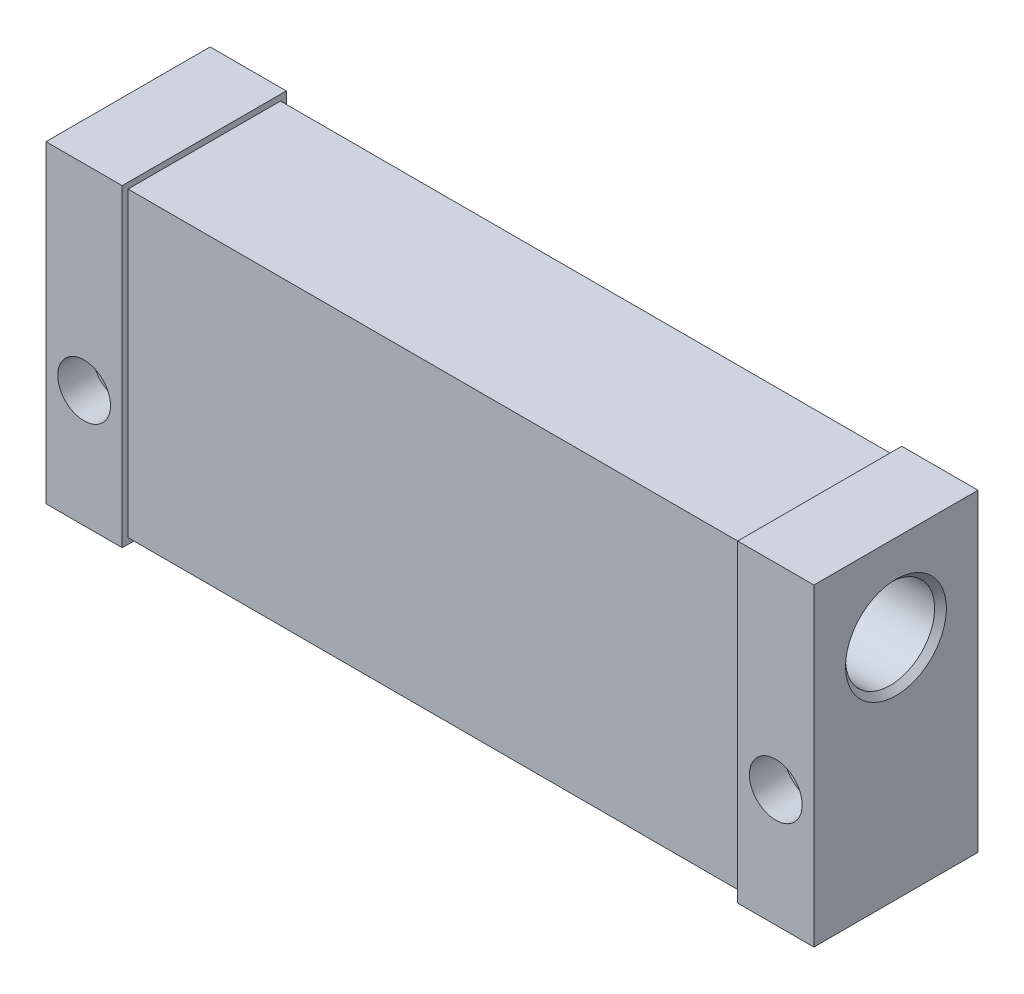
ISO-10303-21;
HEADER;
FILE_DESCRIPTION(('STEP AP214'),'2;1');
FILE_NAME('part.step','',(''),(''),'','','');
FILE_SCHEMA(('AUTOMOTIVE_DESIGN { 1 0 10303 214 1 1 1 1 }'));
ENDSEC;
DATA;
#1=APPLICATION_CONTEXT('core data for automotive mechanical design processes');
#2=APPLICATION_PROTOCOL_DEFINITION('international standard','automotive_design',2000,#1);
#3=PRODUCT_CONTEXT('',#1,'mechanical');
#4=PRODUCT('Part','Part','',(#3));
#5=PRODUCT_RELATED_PRODUCT_CATEGORY('part','',(#4));
#6=PRODUCT_DEFINITION_FORMATION('','',#4);
#7=PRODUCT_DEFINITION_CONTEXT('part definition',#1,'design');
#8=PRODUCT_DEFINITION('design','',#6,#7);
#9=PRODUCT_DEFINITION_SHAPE('','',#8);
#10=(LENGTH_UNIT() NAMED_UNIT(*) SI_UNIT(.MILLI.,.METRE.));
#11=(NAMED_UNIT(*) PLANE_ANGLE_UNIT() SI_UNIT($,.RADIAN.));
#12=(NAMED_UNIT(*) SI_UNIT($,.STERADIAN.) SOLID_ANGLE_UNIT());
#13=UNCERTAINTY_MEASURE_WITH_UNIT(LENGTH_MEASURE(1.E-05),#10,'distance_accuracy_value','');
#14=(GEOMETRIC_REPRESENTATION_CONTEXT(3) GLOBAL_UNCERTAINTY_ASSIGNED_CONTEXT((#13)) GLOBAL_UNIT_ASSIGNED_CONTEXT((#10,
#11,#12)) REPRESENTATION_CONTEXT('',''));
#15=CARTESIAN_POINT('',(0.,0.,0.));
#16=DIRECTION('',(0.,0.,1.));
#17=DIRECTION('',(1.,0.,0.));
#18=AXIS2_PLACEMENT_3D('',#15,#16,#17);
#19=CARTESIAN_POINT('',(-65.5,-26.75,14.));
#20=DIRECTION('',(0.,1.,0.));
#21=DIRECTION('',(0.,0.,1.));
#22=AXIS2_PLACEMENT_3D('',#19,#20,#21);
#23=PLANE('',#22);
#24=CARTESIAN_POINT('',(59.6552513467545,-26.75,-3.));
#25=DIRECTION('',(0.,-1.,0.));
#26=DIRECTION('',(0.,0.,-1.));
#27=AXIS2_PLACEMENT_3D('',#24,#25,#26);
#28=CIRCLE('',#27,2.1);
#29=CARTESIAN_POINT('',(59.6552513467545,-26.75,-5.1));
#30=VERTEX_POINT('',#29);
#31=EDGE_CURVE('E151',#30,#30,#28,.T.);
#32=ORIENTED_EDGE('',*,*,#31,.F.);
#33=EDGE_LOOP('',(#32));
#34=FACE_BOUND('',#33,.T.);
#35=DIRECTION('',(1.,0.,0.));
#36=VECTOR('',#35,1.);
#37=CARTESIAN_POINT('',(-65.5,-26.75,14.));
#38=LINE('',#37,#36);
#39=CARTESIAN_POINT('',(52.5,-26.75,14.));
#40=VERTEX_POINT('',#39);
#41=CARTESIAN_POINT('',(65.5,-26.75,14.));
#42=VERTEX_POINT('',#41);
#43=EDGE_CURVE('E271',#40,#42,#38,.T.);
#44=ORIENTED_EDGE('',*,*,#43,.F.);
#45=DIRECTION('',(0.,0.,-1.));
#46=VECTOR('',#45,1.);
#47=CARTESIAN_POINT('',(52.5,-26.75,14.));
#48=LINE('',#47,#46);
#49=CARTESIAN_POINT('',(52.5,-26.75,-14.));
#50=VERTEX_POINT('',#49);
#51=EDGE_CURVE('E272',#40,#50,#48,.T.);
#52=ORIENTED_EDGE('',*,*,#51,.T.);
#53=DIRECTION('',(1.,0.,0.));
#54=VECTOR('',#53,1.);
#55=CARTESIAN_POINT('',(-65.5,-26.75,-14.));
#56=LINE('',#55,#54);
#57=CARTESIAN_POINT('',(65.5,-26.75,-14.));
#58=VERTEX_POINT('',#57);
#59=EDGE_CURVE('E347',#50,#58,#56,.T.);
#60=ORIENTED_EDGE('',*,*,#59,.T.);
#61=DIRECTION('',(0.,0.,-1.));
#62=VECTOR('',#61,1.);
#63=CARTESIAN_POINT('',(65.5,-26.75,14.));
#64=LINE('',#63,#62);
#65=EDGE_CURVE('E275',#42,#58,#64,.T.);
#66=ORIENTED_EDGE('',*,*,#65,.F.);
#67=EDGE_LOOP('',(#44,#52,#60,#66));
#68=FACE_BOUND('',#67,.T.);
#69=ADVANCED_FACE('F41',(#34,#68),#23,.F.);
#70=CARTESIAN_POINT('',(-65.5,26.75,14.));
#71=DIRECTION('',(0.,-1.,0.));
#72=DIRECTION('',(0.,0.,-1.));
#73=AXIS2_PLACEMENT_3D('',#70,#71,#72);
#74=PLANE('',#73);
#75=DIRECTION('',(-1.,0.,0.));
#76=VECTOR('',#75,1.);
#77=CARTESIAN_POINT('',(-65.5,26.75,-14.));
#78=LINE('',#77,#76);
#79=CARTESIAN_POINT('',(65.5,26.75,-14.));
#80=VERTEX_POINT('',#79);
#81=CARTESIAN_POINT('',(52.5,26.75,-14.));
#82=VERTEX_POINT('',#81);
#83=EDGE_CURVE('E285',#80,#82,#78,.T.);
#84=ORIENTED_EDGE('',*,*,#83,.T.);
#85=DIRECTION('',(0.,0.,1.));
#86=VECTOR('',#85,1.);
#87=CARTESIAN_POINT('',(52.5,26.75,14.));
#88=LINE('',#87,#86);
#89=CARTESIAN_POINT('',(52.5,26.75,14.));
#90=VERTEX_POINT('',#89);
#91=EDGE_CURVE('E64',#82,#90,#88,.T.);
#92=ORIENTED_EDGE('',*,*,#91,.T.);
#93=DIRECTION('',(-1.,0.,0.));
#94=VECTOR('',#93,1.);
#95=CARTESIAN_POINT('',(-65.5,26.75,14.));
#96=LINE('',#95,#94);
#97=CARTESIAN_POINT('',(65.5,26.75,14.));
#98=VERTEX_POINT('',#97);
#99=EDGE_CURVE('E291',#98,#90,#96,.T.);
#100=ORIENTED_EDGE('',*,*,#99,.F.);
#101=DIRECTION('',(0.,0.,-1.));
#102=VECTOR('',#101,1.);
#103=CARTESIAN_POINT('',(65.5,26.75,14.));
#104=LINE('',#103,#102);
#105=EDGE_CURVE('E297',#98,#80,#104,.T.);
#106=ORIENTED_EDGE('',*,*,#105,.T.);
#107=EDGE_LOOP('',(#84,#92,#100,#106));
#108=FACE_BOUND('',#107,.T.);
#109=ADVANCED_FACE('F246',(#108),#74,.F.);
#110=CARTESIAN_POINT('',(-65.5,-26.75,14.));
#111=DIRECTION('',(0.,0.,1.));
#112=DIRECTION('',(1.,0.,0.));
#113=AXIS2_PLACEMENT_3D('',#110,#111,#112);
#114=PLANE('',#113);
#115=CARTESIAN_POINT('',(59.,-6.75,14.));
#116=DIRECTION('',(0.,0.,1.));
#117=DIRECTION('',(1.,0.,0.));
#118=AXIS2_PLACEMENT_3D('',#115,#116,#117);
#119=CIRCLE('',#118,4.5);
#120=CARTESIAN_POINT('',(63.5,-6.75,14.));
#121=VERTEX_POINT('',#120);
#122=EDGE_CURVE('E175',#121,#121,#119,.T.);
#123=ORIENTED_EDGE('',*,*,#122,.F.);
#124=EDGE_LOOP('',(#123));
#125=FACE_BOUND('',#124,.T.);
#126=DIRECTION('',(0.,1.,0.));
#127=VECTOR('',#126,1.);
#128=CARTESIAN_POINT('',(52.5,-26.75,14.));
#129=LINE('',#128,#127);
#130=EDGE_CURVE('E351',#40,#90,#129,.T.);
#131=ORIENTED_EDGE('',*,*,#130,.F.);
#132=ORIENTED_EDGE('',*,*,#43,.T.);
#133=DIRECTION('',(0.,1.,0.));
#134=VECTOR('',#133,1.);
#135=CARTESIAN_POINT('',(65.5,26.75,14.));
#136=LINE('',#135,#134);
#137=EDGE_CURVE('E283',#42,#98,#136,.T.);
#138=ORIENTED_EDGE('',*,*,#137,.T.);
#139=ORIENTED_EDGE('',*,*,#99,.T.);
#140=EDGE_LOOP('',(#131,#132,#138,#139));
#141=FACE_BOUND('',#140,.T.);
#142=ADVANCED_FACE('F241',(#125,#141),#114,.T.);
#143=CARTESIAN_POINT('',(-65.5,-26.75,-14.));
#144=DIRECTION('',(0.,0.,1.));
#145=DIRECTION('',(1.,0.,0.));
#146=AXIS2_PLACEMENT_3D('',#143,#144,#145);
#147=PLANE('',#146);
#148=CARTESIAN_POINT('',(59.,-6.75,-14.));
#149=DIRECTION('',(0.,0.,1.));
#150=DIRECTION('',(1.,0.,0.));
#151=AXIS2_PLACEMENT_3D('',#148,#149,#150);
#152=CIRCLE('',#151,2.74999999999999);
#153=CARTESIAN_POINT('',(61.75,-6.75,-14.));
#154=VERTEX_POINT('',#153);
#155=EDGE_CURVE('E166',#154,#154,#152,.T.);
#156=ORIENTED_EDGE('',*,*,#155,.T.);
#157=EDGE_LOOP('',(#156));
#158=FACE_BOUND('',#157,.T.);
#159=ORIENTED_EDGE('',*,*,#59,.F.);
#160=DIRECTION('',(0.,1.,0.));
#161=VECTOR('',#160,1.);
#162=CARTESIAN_POINT('',(52.5,-26.75,-14.));
#163=LINE('',#162,#161);
#164=EDGE_CURVE('E306',#50,#82,#163,.T.);
#165=ORIENTED_EDGE('',*,*,#164,.T.);
#166=ORIENTED_EDGE('',*,*,#83,.F.);
#167=DIRECTION('',(0.,1.,0.));
#168=VECTOR('',#167,1.);
#169=CARTESIAN_POINT('',(65.5,26.75,-14.));
#170=LINE('',#169,#168);
#171=EDGE_CURVE('E336',#58,#80,#170,.T.);
#172=ORIENTED_EDGE('',*,*,#171,.F.);
#173=EDGE_LOOP('',(#159,#165,#166,#172));
#174=FACE_BOUND('',#173,.T.);
#175=ADVANCED_FACE('F236',(#158,#174),#147,.F.);
#176=CARTESIAN_POINT('',(65.5,26.75,14.));
#177=DIRECTION('',(-1.,0.,0.));
#178=DIRECTION('',(0.,0.,1.));
#179=AXIS2_PLACEMENT_3D('',#176,#177,#178);
#180=PLANE('',#179);
#181=CARTESIAN_POINT('',(65.5,12.,0.));
#182=DIRECTION('',(-1.,0.,0.));
#183=DIRECTION('',(0.,0.,1.));
#184=AXIS2_PLACEMENT_3D('',#181,#182,#183);
#185=CIRCLE('',#184,8.6);
#186=CARTESIAN_POINT('',(65.5,12.,8.6));
#187=VERTEX_POINT('',#186);
#188=EDGE_CURVE('E12',#187,#187,#185,.T.);
#189=ORIENTED_EDGE('',*,*,#188,.T.);
#190=EDGE_LOOP('',(#189));
#191=FACE_BOUND('',#190,.T.);
#192=ORIENTED_EDGE('',*,*,#171,.T.);
#193=ORIENTED_EDGE('',*,*,#105,.F.);
#194=ORIENTED_EDGE('',*,*,#137,.F.);
#195=ORIENTED_EDGE('',*,*,#65,.T.);
#196=EDGE_LOOP('',(#192,#193,#194,#195));
#197=FACE_BOUND('',#196,.T.);
#198=ADVANCED_FACE('F229',(#191,#197),#180,.F.);
#199=CARTESIAN_POINT('',(-52.5,-25.75,13.));
#200=DIRECTION('',(0.,0.,1.));
#201=DIRECTION('',(1.,0.,0.));
#202=AXIS2_PLACEMENT_3D('',#199,#200,#201);
#203=PLANE('',#202);
#204=CARTESIAN_POINT('',(52.5,25.75,13.));
#205=DIRECTION('',(-1.,0.,0.));
#206=VECTOR('',#205,1.);
#207=LINE('',#204,#206);
#208=CARTESIAN_POINT('',(52.5,25.75,13.));
#209=VERTEX_POINT('',#208);
#210=CARTESIAN_POINT('',(-52.5,25.75,13.));
#211=VERTEX_POINT('',#210);
#212=EDGE_CURVE('E205',#209,#211,#207,.T.);
#213=ORIENTED_EDGE('',*,*,#212,.T.);
#214=DIRECTION('',(0.,1.,0.));
#215=VECTOR('',#214,1.);
#216=CARTESIAN_POINT('',(-52.5,-25.75,13.));
#217=LINE('',#216,#215);
#218=CARTESIAN_POINT('',(-52.5,-25.75,13.));
#219=VERTEX_POINT('',#218);
#220=EDGE_CURVE('E182',#219,#211,#217,.T.);
#221=ORIENTED_EDGE('',*,*,#220,.F.);
#222=DIRECTION('',(1.,0.,0.));
#223=VECTOR('',#222,1.);
#224=CARTESIAN_POINT('',(-52.5,-25.75,13.));
#225=LINE('',#224,#223);
#226=CARTESIAN_POINT('',(52.5,-25.7499999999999,13.));
#227=VERTEX_POINT('',#226);
#228=EDGE_CURVE('E179',#219,#227,#225,.T.);
#229=ORIENTED_EDGE('',*,*,#228,.T.);
#230=DIRECTION('',(0.,1.,0.));
#231=VECTOR('',#230,1.);
#232=CARTESIAN_POINT('',(52.5,-25.7499999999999,13.));
#233=LINE('',#232,#231);
#234=EDGE_CURVE('E202',#227,#209,#233,.T.);
#235=ORIENTED_EDGE('',*,*,#234,.T.);
#236=EDGE_LOOP('',(#213,#221,#229,#235));
#237=FACE_BOUND('',#236,.T.);
#238=ADVANCED_FACE('F218',(#237),#203,.T.);
#239=CARTESIAN_POINT('',(-52.5,-25.75,-13.));
#240=DIRECTION('',(0.,1.,0.));
#241=DIRECTION('',(-1.,0.,0.));
#242=AXIS2_PLACEMENT_3D('',#239,#240,#241);
#243=PLANE('',#242);
#244=DIRECTION('',(0.,0.,1.));
#245=VECTOR('',#244,1.);
#246=CARTESIAN_POINT('',(-52.5,-25.75,-13.));
#247=LINE('',#246,#245);
#248=CARTESIAN_POINT('',(-52.5,-25.75,-13.));
#249=VERTEX_POINT('',#248);
#250=EDGE_CURVE('E187',#249,#219,#247,.T.);
#251=ORIENTED_EDGE('',*,*,#250,.F.);
#252=DIRECTION('',(-1.,0.,0.));
#253=VECTOR('',#252,1.);
#254=CARTESIAN_POINT('',(-52.5,-25.75,-13.));
#255=LINE('',#254,#253);
#256=CARTESIAN_POINT('',(52.5,-25.75,-13.));
#257=VERTEX_POINT('',#256);
#258=EDGE_CURVE('E184',#257,#249,#255,.T.);
#259=ORIENTED_EDGE('',*,*,#258,.F.);
#260=DIRECTION('',(0.,0.,1.));
#261=VECTOR('',#260,1.);
#262=CARTESIAN_POINT('',(52.5,-25.75,-13.));
#263=LINE('',#262,#261);
#264=EDGE_CURVE('E183',#257,#227,#263,.T.);
#265=ORIENTED_EDGE('',*,*,#264,.T.);
#266=ORIENTED_EDGE('',*,*,#228,.F.);
#267=EDGE_LOOP('',(#251,#259,#265,#266));
#268=FACE_BOUND('',#267,.T.);
#269=ADVANCED_FACE('F228',(#268),#243,.F.);
#270=CARTESIAN_POINT('',(-52.5000000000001,25.75,-13.));
#271=DIRECTION('',(0.,0.,-1.));
#272=DIRECTION('',(-1.,0.,0.));
#273=AXIS2_PLACEMENT_3D('',#270,#271,#272);
#274=PLANE('',#273);
#275=ORIENTED_EDGE('',*,*,#258,.T.);
#276=DIRECTION('',(0.,-1.,0.));
#277=VECTOR('',#276,1.);
#278=CARTESIAN_POINT('',(-52.5,25.75,-13.));
#279=LINE('',#278,#277);
#280=CARTESIAN_POINT('',(-52.5,25.75,-13.));
#281=VERTEX_POINT('',#280);
#282=EDGE_CURVE('E192',#281,#249,#279,.T.);
#283=ORIENTED_EDGE('',*,*,#282,.F.);
#284=DIRECTION('',(1.,0.,0.));
#285=VECTOR('',#284,1.);
#286=CARTESIAN_POINT('',(-52.5000000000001,25.75,-13.));
#287=LINE('',#286,#285);
#288=CARTESIAN_POINT('',(52.5,25.75,-13.));
#289=VERTEX_POINT('',#288);
#290=EDGE_CURVE('E189',#281,#289,#287,.T.);
#291=ORIENTED_EDGE('',*,*,#290,.T.);
#292=DIRECTION('',(0.,-1.,0.));
#293=VECTOR('',#292,1.);
#294=CARTESIAN_POINT('',(52.5,25.75,-13.));
#295=LINE('',#294,#293);
#296=EDGE_CURVE('E188',#289,#257,#295,.T.);
#297=ORIENTED_EDGE('',*,*,#296,.T.);
#298=EDGE_LOOP('',(#275,#283,#291,#297));
#299=FACE_BOUND('',#298,.T.);
#300=ADVANCED_FACE('F380',(#299),#274,.T.);
#301=CARTESIAN_POINT('',(-52.5,25.75,-225.388235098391));
#302=DIRECTION('',(0.,-1.,0.));
#303=DIRECTION('',(0.,0.,-1.));
#304=AXIS2_PLACEMENT_3D('',#301,#302,#303);
#305=PLANE('',#304);
#306=DIRECTION('',(0.,0.,1.));
#307=VECTOR('',#306,1.);
#308=CARTESIAN_POINT('',(-52.5,25.75,-225.388235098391));
#309=LINE('',#308,#307);
#310=EDGE_CURVE('E178',#281,#211,#309,.T.);
#311=ORIENTED_EDGE('',*,*,#310,.T.);
#312=ORIENTED_EDGE('',*,*,#212,.F.);
#313=DIRECTION('',(0.,0.,1.));
#314=VECTOR('',#313,1.);
#315=CARTESIAN_POINT('',(52.5,25.75,-225.388235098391));
#316=LINE('',#315,#314);
#317=EDGE_CURVE('E193',#289,#209,#316,.T.);
#318=ORIENTED_EDGE('',*,*,#317,.F.);
#319=ORIENTED_EDGE('',*,*,#290,.F.);
#320=EDGE_LOOP('',(#311,#312,#318,#319));
#321=FACE_BOUND('',#320,.T.);
#322=ADVANCED_FACE('F369',(#321),#305,.F.);
#323=CARTESIAN_POINT('',(52.5,29.0354580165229,-225.388235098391));
#324=DIRECTION('',(1.,0.,0.));
#325=DIRECTION('',(0.,0.,-1.));
#326=AXIS2_PLACEMENT_3D('',#323,#324,#325);
#327=PLANE('',#326);
#328=ORIENTED_EDGE('',*,*,#130,.T.);
#329=ORIENTED_EDGE('',*,*,#91,.F.);
#330=ORIENTED_EDGE('',*,*,#164,.F.);
#331=ORIENTED_EDGE('',*,*,#51,.F.);
#332=EDGE_LOOP('',(#328,#329,#330,#331));
#333=FACE_BOUND('',#332,.T.);
#334=ORIENTED_EDGE('',*,*,#317,.T.);
#335=ORIENTED_EDGE('',*,*,#234,.F.);
#336=ORIENTED_EDGE('',*,*,#264,.F.);
#337=ORIENTED_EDGE('',*,*,#296,.F.);
#338=EDGE_LOOP('',(#334,#335,#336,#337));
#339=FACE_BOUND('',#338,.T.);
#340=ADVANCED_FACE('F379',(#333,#339),#327,.F.);
#341=CARTESIAN_POINT('',(-52.5,25.75,-225.388235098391));
#342=DIRECTION('',(-1.,0.,0.));
#343=DIRECTION('',(0.,0.,1.));
#344=AXIS2_PLACEMENT_3D('',#341,#342,#343);
#345=PLANE('',#344);
#346=DIRECTION('',(0.,-1.,0.));
#347=VECTOR('',#346,1.);
#348=CARTESIAN_POINT('',(-52.5,-26.75,14.));
#349=LINE('',#348,#347);
#350=CARTESIAN_POINT('',(-52.5,26.75,14.));
#351=VERTEX_POINT('',#350);
#352=CARTESIAN_POINT('',(-52.5,-26.75,14.));
#353=VERTEX_POINT('',#352);
#354=EDGE_CURVE('E355',#351,#353,#349,.T.);
#355=ORIENTED_EDGE('',*,*,#354,.T.);
#356=DIRECTION('',(0.,0.,1.));
#357=VECTOR('',#356,1.);
#358=CARTESIAN_POINT('',(-52.5,-26.75,14.));
#359=LINE('',#358,#357);
#360=CARTESIAN_POINT('',(-52.5,-26.75,-14.));
#361=VERTEX_POINT('',#360);
#362=EDGE_CURVE('E56',#361,#353,#359,.T.);
#363=ORIENTED_EDGE('',*,*,#362,.F.);
#364=DIRECTION('',(0.,-1.,0.));
#365=VECTOR('',#364,1.);
#366=CARTESIAN_POINT('',(-52.5,-26.75,-14.));
#367=LINE('',#366,#365);
#368=CARTESIAN_POINT('',(-52.5,26.75,-14.));
#369=VERTEX_POINT('',#368);
#370=EDGE_CURVE('E304',#369,#361,#367,.T.);
#371=ORIENTED_EDGE('',*,*,#370,.F.);
#372=DIRECTION('',(0.,0.,-1.));
#373=VECTOR('',#372,1.);
#374=CARTESIAN_POINT('',(-52.5,26.75,14.));
#375=LINE('',#374,#373);
#376=EDGE_CURVE('E358',#351,#369,#375,.T.);
#377=ORIENTED_EDGE('',*,*,#376,.F.);
#378=EDGE_LOOP('',(#355,#363,#371,#377));
#379=FACE_BOUND('',#378,.T.);
#380=ORIENTED_EDGE('',*,*,#282,.T.);
#381=ORIENTED_EDGE('',*,*,#250,.T.);
#382=ORIENTED_EDGE('',*,*,#220,.T.);
#383=ORIENTED_EDGE('',*,*,#310,.F.);
#384=EDGE_LOOP('',(#380,#381,#382,#383));
#385=FACE_BOUND('',#384,.T.);
#386=ADVANCED_FACE('F382',(#379,#385),#345,.F.);
#387=CARTESIAN_POINT('',(-65.5,26.75,14.));
#388=DIRECTION('',(1.,0.,0.));
#389=DIRECTION('',(0.,1.,0.));
#390=AXIS2_PLACEMENT_3D('',#387,#388,#389);
#391=PLANE('',#390);
#392=CARTESIAN_POINT('',(-65.5,12.,0.));
#393=DIRECTION('',(1.,0.,0.));
#394=DIRECTION('',(0.,1.,0.));
#395=AXIS2_PLACEMENT_3D('',#392,#393,#394);
#396=CIRCLE('',#395,8.60000000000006);
#397=CARTESIAN_POINT('',(-65.5,20.6000000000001,0.));
#398=VERTEX_POINT('',#397);
#399=EDGE_CURVE('E49',#398,#398,#396,.T.);
#400=ORIENTED_EDGE('',*,*,#399,.T.);
#401=EDGE_LOOP('',(#400));
#402=FACE_BOUND('',#401,.T.);
#403=DIRECTION('',(0.,-1.,0.));
#404=VECTOR('',#403,1.);
#405=CARTESIAN_POINT('',(-65.5,26.75,-14.));
#406=LINE('',#405,#404);
#407=CARTESIAN_POINT('',(-65.5,26.75,-14.));
#408=VERTEX_POINT('',#407);
#409=CARTESIAN_POINT('',(-65.5,-26.75,-14.));
#410=VERTEX_POINT('',#409);
#411=EDGE_CURVE('E348',#408,#410,#406,.T.);
#412=ORIENTED_EDGE('',*,*,#411,.T.);
#413=DIRECTION('',(0.,0.,-1.));
#414=VECTOR('',#413,1.);
#415=CARTESIAN_POINT('',(-65.5,-26.75,14.));
#416=LINE('',#415,#414);
#417=CARTESIAN_POINT('',(-65.5,-26.75,14.));
#418=VERTEX_POINT('',#417);
#419=EDGE_CURVE('E301',#418,#410,#416,.T.);
#420=ORIENTED_EDGE('',*,*,#419,.F.);
#421=DIRECTION('',(0.,-1.,0.));
#422=VECTOR('',#421,1.);
#423=CARTESIAN_POINT('',(-65.5,26.75,14.));
#424=LINE('',#423,#422);
#425=CARTESIAN_POINT('',(-65.5,26.75,14.));
#426=VERTEX_POINT('',#425);
#427=EDGE_CURVE('E280',#426,#418,#424,.T.);
#428=ORIENTED_EDGE('',*,*,#427,.F.);
#429=DIRECTION('',(0.,0.,-1.));
#430=VECTOR('',#429,1.);
#431=CARTESIAN_POINT('',(-65.5,26.75,14.));
#432=LINE('',#431,#430);
#433=EDGE_CURVE('E294',#426,#408,#432,.T.);
#434=ORIENTED_EDGE('',*,*,#433,.T.);
#435=EDGE_LOOP('',(#412,#420,#428,#434));
#436=FACE_BOUND('',#435,.T.);
#437=ADVANCED_FACE('F43',(#402,#436),#391,.F.);
#438=CARTESIAN_POINT('',(-59.,-6.75,-14.));
#439=DIRECTION('',(0.,0.,1.));
#440=DIRECTION('',(1.,0.,0.));
#441=AXIS2_PLACEMENT_3D('',#438,#439,#440);
#442=CIRCLE('',#441,2.74999999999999);
#443=CARTESIAN_POINT('',(-56.25,-6.75,-14.));
#444=VERTEX_POINT('',#443);
#445=EDGE_CURVE('E154',#444,#444,#442,.T.);
#446=ORIENTED_EDGE('',*,*,#445,.T.);
#447=EDGE_LOOP('',(#446));
#448=FACE_BOUND('',#447,.T.);
#449=EDGE_CURVE('E340',#369,#408,#78,.T.);
#450=ORIENTED_EDGE('',*,*,#449,.F.);
#451=ORIENTED_EDGE('',*,*,#370,.T.);
#452=EDGE_CURVE('E341',#410,#361,#56,.T.);
#453=ORIENTED_EDGE('',*,*,#452,.F.);
#454=ORIENTED_EDGE('',*,*,#411,.F.);
#455=EDGE_LOOP('',(#450,#451,#453,#454));
#456=FACE_BOUND('',#455,.T.);
#457=ADVANCED_FACE('F231',(#448,#456),#147,.F.);
#458=CARTESIAN_POINT('',(-59.,-6.75,14.));
#459=DIRECTION('',(0.,0.,1.));
#460=DIRECTION('',(1.,0.,0.));
#461=AXIS2_PLACEMENT_3D('',#458,#459,#460);
#462=CIRCLE('',#461,4.5);
#463=CARTESIAN_POINT('',(-54.5,-6.75,14.));
#464=VERTEX_POINT('',#463);
#465=EDGE_CURVE('E163',#464,#464,#462,.T.);
#466=ORIENTED_EDGE('',*,*,#465,.F.);
#467=EDGE_LOOP('',(#466));
#468=FACE_BOUND('',#467,.T.);
#469=ORIENTED_EDGE('',*,*,#354,.F.);
#470=EDGE_CURVE('E290',#351,#426,#96,.T.);
#471=ORIENTED_EDGE('',*,*,#470,.T.);
#472=ORIENTED_EDGE('',*,*,#427,.T.);
#473=EDGE_CURVE('E279',#418,#353,#38,.T.);
#474=ORIENTED_EDGE('',*,*,#473,.T.);
#475=EDGE_LOOP('',(#469,#471,#472,#474));
#476=FACE_BOUND('',#475,.T.);
#477=ADVANCED_FACE('F234',(#468,#476),#114,.T.);
#478=ORIENTED_EDGE('',*,*,#470,.F.);
#479=ORIENTED_EDGE('',*,*,#376,.T.);
#480=ORIENTED_EDGE('',*,*,#449,.T.);
#481=ORIENTED_EDGE('',*,*,#433,.F.);
#482=EDGE_LOOP('',(#478,#479,#480,#481));
#483=FACE_BOUND('',#482,.T.);
#484=ADVANCED_FACE('F239',(#483),#74,.F.);
#485=CARTESIAN_POINT('',(-59.,-26.75,-3.));
#486=DIRECTION('',(0.,-1.,0.));
#487=DIRECTION('',(0.,0.,-1.));
#488=AXIS2_PLACEMENT_3D('',#485,#486,#487);
#489=CIRCLE('',#488,2.1);
#490=CARTESIAN_POINT('',(-59.,-26.75,-5.1));
#491=VERTEX_POINT('',#490);
#492=EDGE_CURVE('E143',#491,#491,#489,.T.);
#493=ORIENTED_EDGE('',*,*,#492,.F.);
#494=EDGE_LOOP('',(#493));
#495=FACE_BOUND('',#494,.T.);
#496=ORIENTED_EDGE('',*,*,#452,.T.);
#497=ORIENTED_EDGE('',*,*,#362,.T.);
#498=ORIENTED_EDGE('',*,*,#473,.F.);
#499=ORIENTED_EDGE('',*,*,#419,.T.);
#500=EDGE_LOOP('',(#496,#497,#498,#499));
#501=FACE_BOUND('',#500,.T.);
#502=ADVANCED_FACE('F244',(#495,#501),#23,.F.);
#503=CARTESIAN_POINT('',(65.5,12.,0.));
#504=DIRECTION('',(-1.,0.,0.));
#505=DIRECTION('',(0.,-1.,0.));
#506=AXIS2_PLACEMENT_3D('',#503,#504,#505);
#507=CYLINDRICAL_SURFACE('',#506,7.6);
#508=CARTESIAN_POINT('',(-64.4999999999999,12.,0.));
#509=DIRECTION('',(1.,0.,0.));
#510=DIRECTION('',(0.,1.,0.));
#511=AXIS2_PLACEMENT_3D('',#508,#509,#510);
#512=CIRCLE('',#511,7.6);
#513=CARTESIAN_POINT('',(-64.5,19.6,0.));
#514=VERTEX_POINT('',#513);
#515=EDGE_CURVE('E311',#514,#514,#512,.F.);
#516=ORIENTED_EDGE('',*,*,#515,.T.);
#517=EDGE_LOOP('',(#516));
#518=FACE_BOUND('',#517,.T.);
#519=CARTESIAN_POINT('',(64.5,12.,0.));
#520=DIRECTION('',(-1.,0.,0.));
#521=DIRECTION('',(0.,0.,1.));
#522=AXIS2_PLACEMENT_3D('',#519,#520,#521);
#523=CIRCLE('',#522,7.6);
#524=CARTESIAN_POINT('',(64.5,12.,7.6));
#525=VERTEX_POINT('',#524);
#526=EDGE_CURVE('E308',#525,#525,#523,.F.);
#527=ORIENTED_EDGE('',*,*,#526,.T.);
#528=EDGE_LOOP('',(#527));
#529=FACE_BOUND('',#528,.T.);
#530=ADVANCED_FACE('F250',(#518,#529),#507,.F.);
#531=CARTESIAN_POINT('',(59.,-6.75,14.));
#532=DIRECTION('',(0.,0.,1.));
#533=DIRECTION('',(1.,0.,0.));
#534=AXIS2_PLACEMENT_3D('',#531,#532,#533);
#535=CYLINDRICAL_SURFACE('',#534,4.5);
#536=CARTESIAN_POINT('',(59.,-6.75,8.));
#537=DIRECTION('',(0.,0.,1.));
#538=DIRECTION('',(1.,0.,0.));
#539=AXIS2_PLACEMENT_3D('',#536,#537,#538);
#540=CIRCLE('',#539,4.5);
#541=CARTESIAN_POINT('',(63.5,-6.75,8.));
#542=VERTEX_POINT('',#541);
#543=EDGE_CURVE('E172',#542,#542,#540,.T.);
#544=ORIENTED_EDGE('',*,*,#543,.F.);
#545=EDGE_LOOP('',(#544));
#546=FACE_BOUND('',#545,.T.);
#547=ORIENTED_EDGE('',*,*,#122,.T.);
#548=EDGE_LOOP('',(#547));
#549=FACE_BOUND('',#548,.T.);
#550=ADVANCED_FACE('F255',(#546,#549),#535,.F.);
#551=CARTESIAN_POINT('',(61.75,-6.75,8.));
#552=DIRECTION('',(0.,0.,-1.));
#553=DIRECTION('',(-1.,0.,0.));
#554=AXIS2_PLACEMENT_3D('',#551,#552,#553);
#555=PLANE('',#554);
#556=CARTESIAN_POINT('',(59.,-6.75,8.));
#557=DIRECTION('',(0.,0.,1.));
#558=DIRECTION('',(1.,0.,0.));
#559=AXIS2_PLACEMENT_3D('',#556,#557,#558);
#560=CIRCLE('',#559,2.75);
#561=CARTESIAN_POINT('',(61.75,-6.75,8.));
#562=VERTEX_POINT('',#561);
#563=EDGE_CURVE('E169',#562,#562,#560,.T.);
#564=ORIENTED_EDGE('',*,*,#563,.F.);
#565=EDGE_LOOP('',(#564));
#566=FACE_BOUND('',#565,.T.);
#567=ORIENTED_EDGE('',*,*,#543,.T.);
#568=EDGE_LOOP('',(#567));
#569=FACE_BOUND('',#568,.T.);
#570=ADVANCED_FACE('F412',(#566,#569),#555,.F.);
#571=CARTESIAN_POINT('',(59.,-6.75,14.));
#572=DIRECTION('',(0.,0.,1.));
#573=DIRECTION('',(1.,0.,0.));
#574=AXIS2_PLACEMENT_3D('',#571,#572,#573);
#575=CYLINDRICAL_SURFACE('',#574,2.75);
#576=ORIENTED_EDGE('',*,*,#155,.F.);
#577=EDGE_LOOP('',(#576));
#578=FACE_BOUND('',#577,.T.);
#579=ORIENTED_EDGE('',*,*,#563,.T.);
#580=EDGE_LOOP('',(#579));
#581=FACE_BOUND('',#580,.T.);
#582=ADVANCED_FACE('F418',(#578,#581),#575,.F.);
#583=CARTESIAN_POINT('',(-59.,-6.75,14.));
#584=DIRECTION('',(0.,0.,1.));
#585=DIRECTION('',(1.,0.,0.));
#586=AXIS2_PLACEMENT_3D('',#583,#584,#585);
#587=CYLINDRICAL_SURFACE('',#586,4.5);
#588=CARTESIAN_POINT('',(-59.,-6.75,8.));
#589=DIRECTION('',(0.,0.,1.));
#590=DIRECTION('',(1.,0.,0.));
#591=AXIS2_PLACEMENT_3D('',#588,#589,#590);
#592=CIRCLE('',#591,4.5);
#593=CARTESIAN_POINT('',(-54.5,-6.75,8.));
#594=VERTEX_POINT('',#593);
#595=EDGE_CURVE('E160',#594,#594,#592,.T.);
#596=ORIENTED_EDGE('',*,*,#595,.F.);
#597=EDGE_LOOP('',(#596));
#598=FACE_BOUND('',#597,.T.);
#599=ORIENTED_EDGE('',*,*,#465,.T.);
#600=EDGE_LOOP('',(#599));
#601=FACE_BOUND('',#600,.T.);
#602=ADVANCED_FACE('F425',(#598,#601),#587,.F.);
#603=CARTESIAN_POINT('',(-56.25,-6.75,8.));
#604=DIRECTION('',(0.,0.,-1.));
#605=DIRECTION('',(-1.,0.,0.));
#606=AXIS2_PLACEMENT_3D('',#603,#604,#605);
#607=PLANE('',#606);
#608=CARTESIAN_POINT('',(-59.,-6.75,8.));
#609=DIRECTION('',(0.,0.,1.));
#610=DIRECTION('',(1.,0.,0.));
#611=AXIS2_PLACEMENT_3D('',#608,#609,#610);
#612=CIRCLE('',#611,2.75);
#613=CARTESIAN_POINT('',(-56.25,-6.75,8.));
#614=VERTEX_POINT('',#613);
#615=EDGE_CURVE('E157',#614,#614,#612,.T.);
#616=ORIENTED_EDGE('',*,*,#615,.F.);
#617=EDGE_LOOP('',(#616));
#618=FACE_BOUND('',#617,.T.);
#619=ORIENTED_EDGE('',*,*,#595,.T.);
#620=EDGE_LOOP('',(#619));
#621=FACE_BOUND('',#620,.T.);
#622=ADVANCED_FACE('F429',(#618,#621),#607,.F.);
#623=CARTESIAN_POINT('',(-59.,-6.75,14.));
#624=DIRECTION('',(0.,0.,1.));
#625=DIRECTION('',(1.,0.,0.));
#626=AXIS2_PLACEMENT_3D('',#623,#624,#625);
#627=CYLINDRICAL_SURFACE('',#626,2.75);
#628=ORIENTED_EDGE('',*,*,#445,.F.);
#629=EDGE_LOOP('',(#628));
#630=FACE_BOUND('',#629,.T.);
#631=ORIENTED_EDGE('',*,*,#615,.T.);
#632=EDGE_LOOP('',(#631));
#633=FACE_BOUND('',#632,.T.);
#634=ADVANCED_FACE('F322',(#630,#633),#627,.F.);
#635=CARTESIAN_POINT('',(-64.5,12.,0.));
#636=DIRECTION('',(-1.,0.,0.));
#637=DIRECTION('',(0.,-1.,0.));
#638=AXIS2_PLACEMENT_3D('',#635,#636,#637);
#639=CONICAL_SURFACE('',#638,7.6,0.785398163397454);
#640=ORIENTED_EDGE('',*,*,#399,.F.);
#641=EDGE_LOOP('',(#640));
#642=FACE_BOUND('',#641,.T.);
#643=ORIENTED_EDGE('',*,*,#515,.F.);
#644=EDGE_LOOP('',(#643));
#645=FACE_BOUND('',#644,.T.);
#646=ADVANCED_FACE('F318',(#642,#645),#639,.F.);
#647=CARTESIAN_POINT('',(65.5,12.,0.));
#648=DIRECTION('',(1.,0.,0.));
#649=DIRECTION('',(0.,0.,-1.));
#650=AXIS2_PLACEMENT_3D('',#647,#648,#649);
#651=CONICAL_SURFACE('',#650,8.6,0.785398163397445);
#652=ORIENTED_EDGE('',*,*,#526,.F.);
#653=EDGE_LOOP('',(#652));
#654=FACE_BOUND('',#653,.T.);
#655=ORIENTED_EDGE('',*,*,#188,.F.);
#656=EDGE_LOOP('',(#655));
#657=FACE_BOUND('',#656,.T.);
#658=ADVANCED_FACE('F321',(#654,#657),#651,.F.);
#659=CARTESIAN_POINT('',(59.6552513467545,-26.75,-3.));
#660=DIRECTION('',(0.,-1.,0.));
#661=DIRECTION('',(0.,0.,-1.));
#662=AXIS2_PLACEMENT_3D('',#659,#660,#661);
#663=CYLINDRICAL_SURFACE('',#662,2.1);
#664=CARTESIAN_POINT('',(59.6552513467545,-14.35,-3.));
#665=DIRECTION('',(0.,-1.,0.));
#666=DIRECTION('',(0.,0.,-1.));
#667=AXIS2_PLACEMENT_3D('',#664,#665,#666);
#668=CIRCLE('',#667,2.1);
#669=CARTESIAN_POINT('',(59.6552513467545,-14.35,-5.1));
#670=VERTEX_POINT('',#669);
#671=EDGE_CURVE('E146',#670,#670,#668,.T.);
#672=ORIENTED_EDGE('',*,*,#671,.F.);
#673=EDGE_LOOP('',(#672));
#674=FACE_BOUND('',#673,.T.);
#675=ORIENTED_EDGE('',*,*,#31,.T.);
#676=EDGE_LOOP('',(#675));
#677=FACE_BOUND('',#676,.T.);
#678=ADVANCED_FACE('F330',(#674,#677),#663,.F.);
#679=CARTESIAN_POINT('',(59.6552513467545,-14.35,-3.));
#680=DIRECTION('',(0.,-1.,0.));
#681=DIRECTION('',(0.,0.,-1.));
#682=AXIS2_PLACEMENT_3D('',#679,#680,#681);
#683=CONICAL_SURFACE('',#682,2.1,1.02974425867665);
#684=CARTESIAN_POINT('',(59.6552513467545,-13.0881927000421,-3.));
#685=VERTEX_POINT('',#684);
#686=VERTEX_LOOP('',#685);
#687=FACE_BOUND('',#686,.T.);
#688=ORIENTED_EDGE('',*,*,#671,.T.);
#689=EDGE_LOOP('',(#688));
#690=FACE_BOUND('',#689,.T.);
#691=ADVANCED_FACE('F439',(#687,#690),#683,.F.);
#692=CARTESIAN_POINT('',(-59.,-26.75,-3.));
#693=DIRECTION('',(0.,-1.,0.));
#694=DIRECTION('',(0.,0.,-1.));
#695=AXIS2_PLACEMENT_3D('',#692,#693,#694);
#696=CYLINDRICAL_SURFACE('',#695,2.1);
#697=CARTESIAN_POINT('',(-59.,-14.35,-3.));
#698=DIRECTION('',(0.,-1.,0.));
#699=DIRECTION('',(0.,0.,-1.));
#700=AXIS2_PLACEMENT_3D('',#697,#698,#699);
#701=CIRCLE('',#700,2.1);
#702=CARTESIAN_POINT('',(-59.,-14.35,-5.1));
#703=VERTEX_POINT('',#702);
#704=EDGE_CURVE('E141',#703,#703,#701,.T.);
#705=ORIENTED_EDGE('',*,*,#704,.F.);
#706=EDGE_LOOP('',(#705));
#707=FACE_BOUND('',#706,.T.);
#708=ORIENTED_EDGE('',*,*,#492,.T.);
#709=EDGE_LOOP('',(#708));
#710=FACE_BOUND('',#709,.T.);
#711=ADVANCED_FACE('F137',(#707,#710),#696,.F.);
#712=CARTESIAN_POINT('',(-59.,-14.35,-3.));
#713=DIRECTION('',(0.,-1.,0.));
#714=DIRECTION('',(0.,0.,-1.));
#715=AXIS2_PLACEMENT_3D('',#712,#713,#714);
#716=CONICAL_SURFACE('',#715,2.1,1.02974425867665);
#717=CARTESIAN_POINT('',(-59.,-13.0881927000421,-3.));
#718=VERTEX_POINT('',#717);
#719=VERTEX_LOOP('',#718);
#720=FACE_BOUND('',#719,.T.);
#721=ORIENTED_EDGE('',*,*,#704,.T.);
#722=EDGE_LOOP('',(#721));
#723=FACE_BOUND('',#722,.T.);
#724=ADVANCED_FACE('F134',(#720,#723),#716,.F.);
#725=CLOSED_SHELL('',(#69,#109,#142,#175,#198,#238,#269,#300,#322,#340,#386,#437,#457,#477,#484,
#502,#530,#550,#570,#582,#602,#622,#634,#646,#658,#678,#691,#711,#724));
#726=MANIFOLD_SOLID_BREP('B2',#725);
#727=ADVANCED_BREP_SHAPE_REPRESENTATION('',(#18,#726),#14);
#728=SHAPE_DEFINITION_REPRESENTATION(#9,#727);
ENDSEC;
END-ISO-10303-21;
